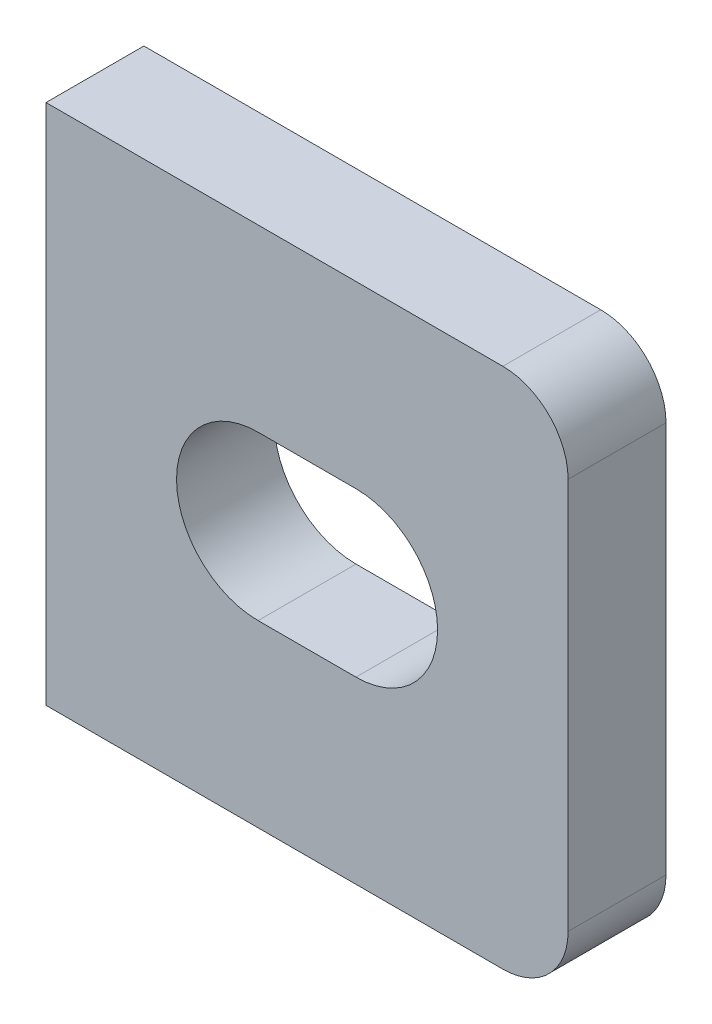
ISO-10303-21;
HEADER;
FILE_DESCRIPTION(('STEP AP214'),'2;1');
FILE_NAME('part.step','',(''),(''),'','','');
FILE_SCHEMA(('AUTOMOTIVE_DESIGN { 1 0 10303 214 1 1 1 1 }'));
ENDSEC;
DATA;
#1=APPLICATION_CONTEXT('core data for automotive mechanical design processes');
#2=APPLICATION_PROTOCOL_DEFINITION('international standard','automotive_design',2000,#1);
#3=PRODUCT_CONTEXT('',#1,'mechanical');
#4=PRODUCT('Part','Part','',(#3));
#5=PRODUCT_RELATED_PRODUCT_CATEGORY('part','',(#4));
#6=PRODUCT_DEFINITION_FORMATION('','',#4);
#7=PRODUCT_DEFINITION_CONTEXT('part definition',#1,'design');
#8=PRODUCT_DEFINITION('design','',#6,#7);
#9=PRODUCT_DEFINITION_SHAPE('','',#8);
#10=(LENGTH_UNIT() NAMED_UNIT(*) SI_UNIT(.MILLI.,.METRE.));
#11=(NAMED_UNIT(*) PLANE_ANGLE_UNIT() SI_UNIT($,.RADIAN.));
#12=(NAMED_UNIT(*) SI_UNIT($,.STERADIAN.) SOLID_ANGLE_UNIT());
#13=UNCERTAINTY_MEASURE_WITH_UNIT(LENGTH_MEASURE(1.E-05),#10,'distance_accuracy_value','');
#14=(GEOMETRIC_REPRESENTATION_CONTEXT(3) GLOBAL_UNCERTAINTY_ASSIGNED_CONTEXT((#13)) GLOBAL_UNIT_ASSIGNED_CONTEXT((#10,
#11,#12)) REPRESENTATION_CONTEXT('',''));
#15=CARTESIAN_POINT('',(0.,0.,0.));
#16=DIRECTION('',(0.,0.,1.));
#17=DIRECTION('',(1.,0.,0.));
#18=AXIS2_PLACEMENT_3D('',#15,#16,#17);
#19=CARTESIAN_POINT('',(0.,50.8000000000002,-9.52500000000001));
#20=DIRECTION('',(-1.,0.,0.));
#21=DIRECTION('',(0.,0.,0.999999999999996));
#22=AXIS2_PLACEMENT_3D('',#19,#20,#21);
#23=PLANE('',#22);
#24=DIRECTION('',(0.,-0.999999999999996,0.));
#25=VECTOR('',#24,1.);
#26=CARTESIAN_POINT('',(0.,50.8000000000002,0.));
#27=LINE('',#26,#25);
#28=CARTESIAN_POINT('',(0.,50.8000000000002,0.));
#29=VERTEX_POINT('',#28);
#30=CARTESIAN_POINT('',(0.,0.,0.));
#31=VERTEX_POINT('',#30);
#32=EDGE_CURVE('E144',#29,#31,#27,.T.);
#33=ORIENTED_EDGE('',*,*,#32,.F.);
#34=DIRECTION('',(0.,0.,0.999999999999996));
#35=VECTOR('',#34,1.);
#36=CARTESIAN_POINT('',(0.,50.8000000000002,-9.52500000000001));
#37=LINE('',#36,#35);
#38=CARTESIAN_POINT('',(0.,50.8000000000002,-9.52500000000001));
#39=VERTEX_POINT('',#38);
#40=EDGE_CURVE('E11',#39,#29,#37,.T.);
#41=ORIENTED_EDGE('',*,*,#40,.F.);
#42=DIRECTION('',(0.,-0.999999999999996,0.));
#43=VECTOR('',#42,1.);
#44=CARTESIAN_POINT('',(0.,50.8000000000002,-9.52500000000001));
#45=LINE('',#44,#43);
#46=CARTESIAN_POINT('',(0.,0.,-9.52500000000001));
#47=VERTEX_POINT('',#46);
#48=EDGE_CURVE('E148',#39,#47,#45,.T.);
#49=ORIENTED_EDGE('',*,*,#48,.T.);
#50=DIRECTION('',(0.,0.,0.999999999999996));
#51=VECTOR('',#50,1.);
#52=CARTESIAN_POINT('',(0.,0.,-9.52500000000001));
#53=LINE('',#52,#51);
#54=EDGE_CURVE('E37',#47,#31,#53,.T.);
#55=ORIENTED_EDGE('',*,*,#54,.T.);
#56=EDGE_LOOP('',(#33,#41,#49,#55));
#57=FACE_BOUND('',#56,.T.);
#58=ADVANCED_FACE('F34',(#57),#23,.T.);
#59=CARTESIAN_POINT('',(44.4499999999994,50.7999999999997,-9.52500000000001));
#60=DIRECTION('',(0.,0.999999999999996,0.));
#61=DIRECTION('',(0.,0.,0.999999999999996));
#62=AXIS2_PLACEMENT_3D('',#59,#60,#61);
#63=PLANE('',#62);
#64=DIRECTION('',(-1.,0.,0.));
#65=VECTOR('',#64,1.);
#66=CARTESIAN_POINT('',(44.4499999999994,50.7999999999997,0.));
#67=LINE('',#66,#65);
#68=CARTESIAN_POINT('',(44.4499999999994,50.7999999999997,0.));
#69=VERTEX_POINT('',#68);
#70=EDGE_CURVE('E152',#69,#29,#67,.T.);
#71=ORIENTED_EDGE('',*,*,#70,.F.);
#72=DIRECTION('',(0.,0.,0.999999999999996));
#73=VECTOR('',#72,1.);
#74=CARTESIAN_POINT('',(44.4499999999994,50.7999999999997,-9.52500000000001));
#75=LINE('',#74,#73);
#76=CARTESIAN_POINT('',(44.4499999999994,50.7999999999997,-9.52500000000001));
#77=VERTEX_POINT('',#76);
#78=EDGE_CURVE('E42',#77,#69,#75,.T.);
#79=ORIENTED_EDGE('',*,*,#78,.F.);
#80=DIRECTION('',(-1.,0.,0.));
#81=VECTOR('',#80,1.);
#82=CARTESIAN_POINT('',(44.4499999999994,50.7999999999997,-9.52500000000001));
#83=LINE('',#82,#81);
#84=EDGE_CURVE('E164',#77,#39,#83,.T.);
#85=ORIENTED_EDGE('',*,*,#84,.T.);
#86=ORIENTED_EDGE('',*,*,#40,.T.);
#87=EDGE_LOOP('',(#71,#79,#85,#86));
#88=FACE_BOUND('',#87,.T.);
#89=ADVANCED_FACE('F201',(#88),#63,.T.);
#90=CARTESIAN_POINT('',(44.4499999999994,44.4499999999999,-9.52500000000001));
#91=DIRECTION('',(0.,0.,0.999999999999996));
#92=DIRECTION('',(1.,0.,0.));
#93=AXIS2_PLACEMENT_3D('',#90,#91,#92);
#94=CYLINDRICAL_SURFACE('',#93,6.35000000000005);
#95=CARTESIAN_POINT('',(44.4499999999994,44.4499999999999,0.));
#96=DIRECTION('',(0.,0.,0.999999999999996));
#97=DIRECTION('',(1.,0.,0.));
#98=AXIS2_PLACEMENT_3D('',#95,#96,#97);
#99=CIRCLE('',#98,6.35000000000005);
#100=CARTESIAN_POINT('',(50.7999999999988,44.4499999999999,0.));
#101=VERTEX_POINT('',#100);
#102=EDGE_CURVE('E178',#101,#69,#99,.T.);
#103=ORIENTED_EDGE('',*,*,#102,.F.);
#104=DIRECTION('',(0.,0.,0.999999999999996));
#105=VECTOR('',#104,1.);
#106=CARTESIAN_POINT('',(50.7999999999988,44.4499999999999,-9.52500000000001));
#107=LINE('',#106,#105);
#108=CARTESIAN_POINT('',(50.7999999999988,44.4499999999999,-9.52500000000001));
#109=VERTEX_POINT('',#108);
#110=EDGE_CURVE('E184',#109,#101,#107,.T.);
#111=ORIENTED_EDGE('',*,*,#110,.F.);
#112=CARTESIAN_POINT('',(44.4499999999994,44.4499999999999,-9.52500000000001));
#113=DIRECTION('',(0.,0.,0.999999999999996));
#114=DIRECTION('',(1.,0.,0.));
#115=AXIS2_PLACEMENT_3D('',#112,#113,#114);
#116=CIRCLE('',#115,6.35000000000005);
#117=EDGE_CURVE('E161',#109,#77,#116,.T.);
#118=ORIENTED_EDGE('',*,*,#117,.T.);
#119=ORIENTED_EDGE('',*,*,#78,.T.);
#120=EDGE_LOOP('',(#103,#111,#118,#119));
#121=FACE_BOUND('',#120,.T.);
#122=ADVANCED_FACE('F212',(#121),#94,.T.);
#123=CARTESIAN_POINT('',(50.8000000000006,6.34999999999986,-9.52500000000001));
#124=DIRECTION('',(1.,0.,0.));
#125=DIRECTION('',(0.,0.,-0.999999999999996));
#126=AXIS2_PLACEMENT_3D('',#123,#124,#125);
#127=PLANE('',#126);
#128=DIRECTION('',(0.,0.999999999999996,0.));
#129=VECTOR('',#128,1.);
#130=CARTESIAN_POINT('',(50.8000000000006,6.34999999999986,0.));
#131=LINE('',#130,#129);
#132=CARTESIAN_POINT('',(50.8000000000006,6.34999999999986,0.));
#133=VERTEX_POINT('',#132);
#134=EDGE_CURVE('E175',#133,#101,#131,.T.);
#135=ORIENTED_EDGE('',*,*,#134,.F.);
#136=DIRECTION('',(0.,0.,0.999999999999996));
#137=VECTOR('',#136,1.);
#138=CARTESIAN_POINT('',(50.8000000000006,6.34999999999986,-9.52500000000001));
#139=LINE('',#138,#137);
#140=CARTESIAN_POINT('',(50.8000000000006,6.34999999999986,-9.52500000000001));
#141=VERTEX_POINT('',#140);
#142=EDGE_CURVE('E186',#141,#133,#139,.T.);
#143=ORIENTED_EDGE('',*,*,#142,.F.);
#144=DIRECTION('',(0.,0.999999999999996,0.));
#145=VECTOR('',#144,1.);
#146=CARTESIAN_POINT('',(50.8000000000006,6.34999999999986,-9.52500000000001));
#147=LINE('',#146,#145);
#148=EDGE_CURVE('E158',#141,#109,#147,.T.);
#149=ORIENTED_EDGE('',*,*,#148,.T.);
#150=ORIENTED_EDGE('',*,*,#110,.T.);
#151=EDGE_LOOP('',(#135,#143,#149,#150));
#152=FACE_BOUND('',#151,.T.);
#153=ADVANCED_FACE('F210',(#152),#127,.T.);
#154=CARTESIAN_POINT('',(44.4499999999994,6.34999999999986,-9.52500000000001));
#155=DIRECTION('',(0.,0.,0.999999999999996));
#156=DIRECTION('',(1.,0.,0.));
#157=AXIS2_PLACEMENT_3D('',#154,#155,#156);
#158=CYLINDRICAL_SURFACE('',#157,6.35000000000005);
#159=CARTESIAN_POINT('',(44.4499999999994,6.34999999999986,0.));
#160=DIRECTION('',(0.,0.,0.999999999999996));
#161=DIRECTION('',(1.,0.,0.));
#162=AXIS2_PLACEMENT_3D('',#159,#160,#161);
#163=CIRCLE('',#162,6.35000000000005);
#164=CARTESIAN_POINT('',(44.4499999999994,0.,0.));
#165=VERTEX_POINT('',#164);
#166=EDGE_CURVE('E172',#165,#133,#163,.T.);
#167=ORIENTED_EDGE('',*,*,#166,.F.);
#168=DIRECTION('',(0.,0.,0.999999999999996));
#169=VECTOR('',#168,1.);
#170=CARTESIAN_POINT('',(44.4499999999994,0.,-9.52500000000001));
#171=LINE('',#170,#169);
#172=CARTESIAN_POINT('',(44.4499999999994,0.,-9.52500000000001));
#173=VERTEX_POINT('',#172);
#174=EDGE_CURVE('E187',#173,#165,#171,.T.);
#175=ORIENTED_EDGE('',*,*,#174,.F.);
#176=CARTESIAN_POINT('',(44.4499999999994,6.34999999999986,-9.52500000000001));
#177=DIRECTION('',(0.,0.,0.999999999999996));
#178=DIRECTION('',(1.,0.,0.));
#179=AXIS2_PLACEMENT_3D('',#176,#177,#178);
#180=CIRCLE('',#179,6.35000000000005);
#181=EDGE_CURVE('E155',#173,#141,#180,.T.);
#182=ORIENTED_EDGE('',*,*,#181,.T.);
#183=ORIENTED_EDGE('',*,*,#142,.T.);
#184=EDGE_LOOP('',(#167,#175,#182,#183));
#185=FACE_BOUND('',#184,.T.);
#186=ADVANCED_FACE('F207',(#185),#158,.T.);
#187=CARTESIAN_POINT('',(0.,0.,-9.52500000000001));
#188=DIRECTION('',(0.,-0.999999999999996,0.));
#189=DIRECTION('',(0.,0.,-0.999999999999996));
#190=AXIS2_PLACEMENT_3D('',#187,#188,#189);
#191=PLANE('',#190);
#192=DIRECTION('',(1.,0.,0.));
#193=VECTOR('',#192,1.);
#194=CARTESIAN_POINT('',(0.,0.,0.));
#195=LINE('',#194,#193);
#196=EDGE_CURVE('E169',#31,#165,#195,.T.);
#197=ORIENTED_EDGE('',*,*,#196,.F.);
#198=ORIENTED_EDGE('',*,*,#54,.F.);
#199=DIRECTION('',(1.,0.,0.));
#200=VECTOR('',#199,1.);
#201=CARTESIAN_POINT('',(0.,0.,-9.52500000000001));
#202=LINE('',#201,#200);
#203=EDGE_CURVE('E151',#47,#173,#202,.T.);
#204=ORIENTED_EDGE('',*,*,#203,.T.);
#205=ORIENTED_EDGE('',*,*,#174,.T.);
#206=EDGE_LOOP('',(#197,#198,#204,#205));
#207=FACE_BOUND('',#206,.T.);
#208=ADVANCED_FACE('F195',(#207),#191,.T.);
#209=CARTESIAN_POINT('',(44.4499999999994,6.34999999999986,-9.52500000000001));
#210=DIRECTION('',(0.,0.,0.999999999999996));
#211=DIRECTION('',(1.,0.,0.));
#212=AXIS2_PLACEMENT_3D('',#209,#210,#211);
#213=PLANE('',#212);
#214=DIRECTION('',(1.,0.,0.));
#215=VECTOR('',#214,1.);
#216=CARTESIAN_POINT('',(20.6374999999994,17.4625000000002,-9.52500000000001));
#217=LINE('',#216,#215);
#218=CARTESIAN_POINT('',(20.6374999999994,17.4625000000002,-9.52500000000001));
#219=VERTEX_POINT('',#218);
#220=CARTESIAN_POINT('',(30.1624999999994,17.4625000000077,-9.52500000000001));
#221=VERTEX_POINT('',#220);
#222=EDGE_CURVE('E119',#219,#221,#217,.T.);
#223=ORIENTED_EDGE('',*,*,#222,.T.);
#224=CARTESIAN_POINT('',(30.1624999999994,25.4000000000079,-9.52500000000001));
#225=DIRECTION('',(0.,0.,0.999999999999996));
#226=DIRECTION('',(1.,0.,0.));
#227=AXIS2_PLACEMENT_3D('',#224,#225,#226);
#228=CIRCLE('',#227,7.9375);
#229=CARTESIAN_POINT('',(30.1624999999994,33.3375000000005,-9.52500000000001));
#230=VERTEX_POINT('',#229);
#231=EDGE_CURVE('E113',#221,#230,#228,.T.);
#232=ORIENTED_EDGE('',*,*,#231,.T.);
#233=DIRECTION('',(-1.,0.,0.));
#234=VECTOR('',#233,1.);
#235=CARTESIAN_POINT('',(30.1624999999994,33.3375000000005,-9.52500000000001));
#236=LINE('',#235,#234);
#237=CARTESIAN_POINT('',(20.6374999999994,33.3375,-9.52500000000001));
#238=VERTEX_POINT('',#237);
#239=EDGE_CURVE('E122',#230,#238,#236,.T.);
#240=ORIENTED_EDGE('',*,*,#239,.T.);
#241=CARTESIAN_POINT('',(20.6374999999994,25.4000000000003,-9.52500000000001));
#242=DIRECTION('',(0.,0.,0.999999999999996));
#243=DIRECTION('',(1.,0.,0.));
#244=AXIS2_PLACEMENT_3D('',#241,#242,#243);
#245=CIRCLE('',#244,7.9375);
#246=EDGE_CURVE('E50',#238,#219,#245,.T.);
#247=ORIENTED_EDGE('',*,*,#246,.T.);
#248=EDGE_LOOP('',(#223,#232,#240,#247));
#249=FACE_BOUND('',#248,.T.);
#250=ORIENTED_EDGE('',*,*,#48,.F.);
#251=ORIENTED_EDGE('',*,*,#84,.F.);
#252=ORIENTED_EDGE('',*,*,#117,.F.);
#253=ORIENTED_EDGE('',*,*,#148,.F.);
#254=ORIENTED_EDGE('',*,*,#181,.F.);
#255=ORIENTED_EDGE('',*,*,#203,.F.);
#256=EDGE_LOOP('',(#250,#251,#252,#253,#254,#255));
#257=FACE_BOUND('',#256,.T.);
#258=ADVANCED_FACE('F126',(#249,#257),#213,.F.);
#259=CARTESIAN_POINT('',(44.4499999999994,6.34999999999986,0.));
#260=DIRECTION('',(0.,0.,0.999999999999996));
#261=DIRECTION('',(1.,0.,0.));
#262=AXIS2_PLACEMENT_3D('',#259,#260,#261);
#263=PLANE('',#262);
#264=CARTESIAN_POINT('',(30.1624999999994,25.4000000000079,0.));
#265=DIRECTION('',(0.,0.,0.999999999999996));
#266=DIRECTION('',(1.,0.,0.));
#267=AXIS2_PLACEMENT_3D('',#264,#265,#266);
#268=CIRCLE('',#267,7.9375);
#269=CARTESIAN_POINT('',(30.1624999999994,17.4625000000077,0.));
#270=VERTEX_POINT('',#269);
#271=CARTESIAN_POINT('',(30.1624999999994,33.3375000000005,0.));
#272=VERTEX_POINT('',#271);
#273=EDGE_CURVE('E58',#270,#272,#268,.T.);
#274=ORIENTED_EDGE('',*,*,#273,.F.);
#275=DIRECTION('',(1.,0.,0.));
#276=VECTOR('',#275,1.);
#277=CARTESIAN_POINT('',(20.6374999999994,17.4625000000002,0.));
#278=LINE('',#277,#276);
#279=CARTESIAN_POINT('',(20.6374999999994,17.4625000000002,0.));
#280=VERTEX_POINT('',#279);
#281=EDGE_CURVE('E129',#280,#270,#278,.T.);
#282=ORIENTED_EDGE('',*,*,#281,.F.);
#283=CARTESIAN_POINT('',(20.6374999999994,25.4000000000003,0.));
#284=DIRECTION('',(0.,0.,0.999999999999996));
#285=DIRECTION('',(1.,0.,0.));
#286=AXIS2_PLACEMENT_3D('',#283,#284,#285);
#287=CIRCLE('',#286,7.9375);
#288=CARTESIAN_POINT('',(20.6374999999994,33.3375,0.));
#289=VERTEX_POINT('',#288);
#290=EDGE_CURVE('E132',#289,#280,#287,.T.);
#291=ORIENTED_EDGE('',*,*,#290,.F.);
#292=DIRECTION('',(-1.,0.,0.));
#293=VECTOR('',#292,1.);
#294=CARTESIAN_POINT('',(30.1624999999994,33.3375000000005,0.));
#295=LINE('',#294,#293);
#296=EDGE_CURVE('E138',#272,#289,#295,.T.);
#297=ORIENTED_EDGE('',*,*,#296,.F.);
#298=EDGE_LOOP('',(#274,#282,#291,#297));
#299=FACE_BOUND('',#298,.T.);
#300=ORIENTED_EDGE('',*,*,#32,.T.);
#301=ORIENTED_EDGE('',*,*,#196,.T.);
#302=ORIENTED_EDGE('',*,*,#166,.T.);
#303=ORIENTED_EDGE('',*,*,#134,.T.);
#304=ORIENTED_EDGE('',*,*,#102,.T.);
#305=ORIENTED_EDGE('',*,*,#70,.T.);
#306=EDGE_LOOP('',(#300,#301,#302,#303,#304,#305));
#307=FACE_BOUND('',#306,.T.);
#308=ADVANCED_FACE('F197',(#299,#307),#263,.T.);
#309=CARTESIAN_POINT('',(30.1624999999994,25.4000000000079,-9.52500000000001));
#310=DIRECTION('',(0.,0.,0.999999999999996));
#311=DIRECTION('',(1.,0.,0.));
#312=AXIS2_PLACEMENT_3D('',#309,#310,#311);
#313=CYLINDRICAL_SURFACE('',#312,7.9375);
#314=ORIENTED_EDGE('',*,*,#273,.T.);
#315=DIRECTION('',(0.,0.,0.999999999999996));
#316=VECTOR('',#315,1.);
#317=CARTESIAN_POINT('',(30.1624999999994,33.3375000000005,-9.52500000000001));
#318=LINE('',#317,#316);
#319=EDGE_CURVE('E109',#230,#272,#318,.T.);
#320=ORIENTED_EDGE('',*,*,#319,.F.);
#321=ORIENTED_EDGE('',*,*,#231,.F.);
#322=DIRECTION('',(0.,0.,0.999999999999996));
#323=VECTOR('',#322,1.);
#324=CARTESIAN_POINT('',(30.1624999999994,17.4625000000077,-9.52500000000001));
#325=LINE('',#324,#323);
#326=EDGE_CURVE('E142',#221,#270,#325,.T.);
#327=ORIENTED_EDGE('',*,*,#326,.T.);
#328=EDGE_LOOP('',(#314,#320,#321,#327));
#329=FACE_BOUND('',#328,.T.);
#330=ADVANCED_FACE('F111',(#329),#313,.F.);
#331=CARTESIAN_POINT('',(20.6374999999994,17.4625000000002,-9.52500000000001));
#332=DIRECTION('',(0.,-0.999999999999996,0.));
#333=DIRECTION('',(0.,0.,-0.999999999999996));
#334=AXIS2_PLACEMENT_3D('',#331,#332,#333);
#335=PLANE('',#334);
#336=ORIENTED_EDGE('',*,*,#281,.T.);
#337=ORIENTED_EDGE('',*,*,#326,.F.);
#338=ORIENTED_EDGE('',*,*,#222,.F.);
#339=DIRECTION('',(0.,0.,0.999999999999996));
#340=VECTOR('',#339,1.);
#341=CARTESIAN_POINT('',(20.6374999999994,17.4625000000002,-9.52500000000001));
#342=LINE('',#341,#340);
#343=EDGE_CURVE('E145',#219,#280,#342,.T.);
#344=ORIENTED_EDGE('',*,*,#343,.T.);
#345=EDGE_LOOP('',(#336,#337,#338,#344));
#346=FACE_BOUND('',#345,.T.);
#347=ADVANCED_FACE('F286',(#346),#335,.F.);
#348=CARTESIAN_POINT('',(20.6374999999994,25.4000000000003,-9.52500000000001));
#349=DIRECTION('',(0.,0.,0.999999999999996));
#350=DIRECTION('',(1.,0.,0.));
#351=AXIS2_PLACEMENT_3D('',#348,#349,#350);
#352=CYLINDRICAL_SURFACE('',#351,7.9375);
#353=ORIENTED_EDGE('',*,*,#290,.T.);
#354=ORIENTED_EDGE('',*,*,#343,.F.);
#355=ORIENTED_EDGE('',*,*,#246,.F.);
#356=DIRECTION('',(0.,0.,0.999999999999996));
#357=VECTOR('',#356,1.);
#358=CARTESIAN_POINT('',(20.6374999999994,33.3375,-9.52500000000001));
#359=LINE('',#358,#357);
#360=EDGE_CURVE('E118',#238,#289,#359,.T.);
#361=ORIENTED_EDGE('',*,*,#360,.T.);
#362=EDGE_LOOP('',(#353,#354,#355,#361));
#363=FACE_BOUND('',#362,.T.);
#364=ADVANCED_FACE('F296',(#363),#352,.F.);
#365=CARTESIAN_POINT('',(30.1624999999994,33.3375000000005,-9.52500000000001));
#366=DIRECTION('',(0.,0.999999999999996,0.));
#367=DIRECTION('',(0.,0.,0.999999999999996));
#368=AXIS2_PLACEMENT_3D('',#365,#366,#367);
#369=PLANE('',#368);
#370=ORIENTED_EDGE('',*,*,#296,.T.);
#371=ORIENTED_EDGE('',*,*,#360,.F.);
#372=ORIENTED_EDGE('',*,*,#239,.F.);
#373=ORIENTED_EDGE('',*,*,#319,.T.);
#374=EDGE_LOOP('',(#370,#371,#372,#373));
#375=FACE_BOUND('',#374,.T.);
#376=ADVANCED_FACE('F123',(#375),#369,.F.);
#377=CLOSED_SHELL('',(#58,#89,#122,#153,#186,#208,#258,#308,#330,#347,#364,#376));
#378=MANIFOLD_SOLID_BREP('B2',#377);
#379=ADVANCED_BREP_SHAPE_REPRESENTATION('',(#18,#378),#14);
#380=SHAPE_DEFINITION_REPRESENTATION(#9,#379);
ENDSEC;
END-ISO-10303-21;
